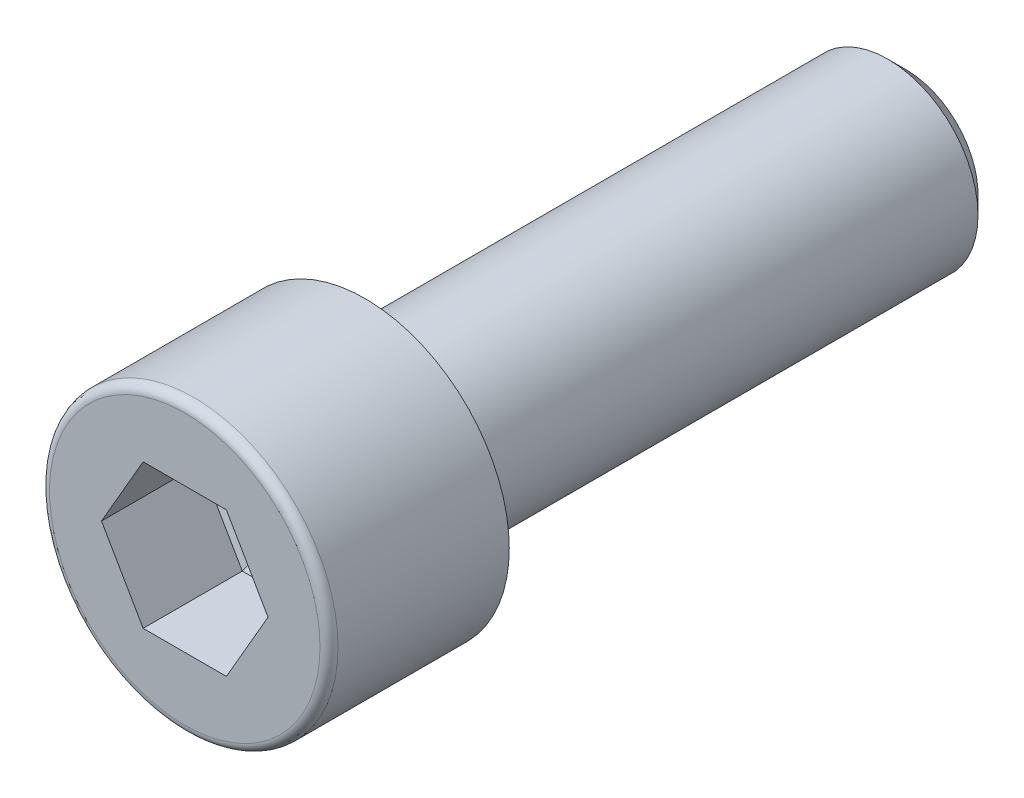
ISO-10303-21;
HEADER;
FILE_DESCRIPTION(('STEP AP214'),'2;1');
FILE_NAME('part.step','',(''),(''),'','','');
FILE_SCHEMA(('AUTOMOTIVE_DESIGN { 1 0 10303 214 1 1 1 1 }'));
ENDSEC;
DATA;
#1=APPLICATION_CONTEXT('core data for automotive mechanical design processes');
#2=APPLICATION_PROTOCOL_DEFINITION('international standard','automotive_design',2000,#1);
#3=PRODUCT_CONTEXT('',#1,'mechanical');
#4=PRODUCT('Part','Part','',(#3));
#5=PRODUCT_RELATED_PRODUCT_CATEGORY('part','',(#4));
#6=PRODUCT_DEFINITION_FORMATION('','',#4);
#7=PRODUCT_DEFINITION_CONTEXT('part definition',#1,'design');
#8=PRODUCT_DEFINITION('design','',#6,#7);
#9=PRODUCT_DEFINITION_SHAPE('','',#8);
#10=(LENGTH_UNIT() NAMED_UNIT(*) SI_UNIT(.MILLI.,.METRE.));
#11=(NAMED_UNIT(*) PLANE_ANGLE_UNIT() SI_UNIT($,.RADIAN.));
#12=(NAMED_UNIT(*) SI_UNIT($,.STERADIAN.) SOLID_ANGLE_UNIT());
#13=UNCERTAINTY_MEASURE_WITH_UNIT(LENGTH_MEASURE(1.E-05),#10,'distance_accuracy_value','');
#14=(GEOMETRIC_REPRESENTATION_CONTEXT(3) GLOBAL_UNCERTAINTY_ASSIGNED_CONTEXT((#13)) GLOBAL_UNIT_ASSIGNED_CONTEXT((#10,
#11,#12)) REPRESENTATION_CONTEXT('',''));
#15=CARTESIAN_POINT('',(0.,0.,0.));
#16=DIRECTION('',(0.,0.,1.));
#17=DIRECTION('',(1.,0.,0.));
#18=AXIS2_PLACEMENT_3D('',#15,#16,#17);
#19=CARTESIAN_POINT('',(0.,0.,0.));
#20=DIRECTION('',(0.,0.,1.));
#21=DIRECTION('',(1.,0.,0.));
#22=AXIS2_PLACEMENT_3D('',#19,#20,#21);
#23=PLANE('',#22);
#24=CARTESIAN_POINT('',(0.,0.,0.));
#25=DIRECTION('',(0.,0.,1.));
#26=DIRECTION('',(1.,0.,0.));
#27=AXIS2_PLACEMENT_3D('',#24,#25,#26);
#28=CIRCLE('',#27,8.);
#29=CARTESIAN_POINT('',(8.,0.,0.));
#30=VERTEX_POINT('',#29);
#31=EDGE_CURVE('E145',#30,#30,#28,.T.);
#32=ORIENTED_EDGE('',*,*,#31,.F.);
#33=EDGE_LOOP('',(#32));
#34=FACE_BOUND('',#33,.T.);
#35=CARTESIAN_POINT('',(0.,0.,0.));
#36=DIRECTION('',(0.,0.,1.));
#37=DIRECTION('',(1.,0.,0.));
#38=AXIS2_PLACEMENT_3D('',#35,#36,#37);
#39=CIRCLE('',#38,5.);
#40=CARTESIAN_POINT('',(5.,0.,0.));
#41=VERTEX_POINT('',#40);
#42=EDGE_CURVE('E163',#41,#41,#39,.F.);
#43=ORIENTED_EDGE('',*,*,#42,.F.);
#44=EDGE_LOOP('',(#43));
#45=FACE_BOUND('',#44,.T.);
#46=ADVANCED_FACE('F26',(#34,#45),#23,.F.);
#47=CARTESIAN_POINT('',(0.,0.,10.));
#48=DIRECTION('',(0.,0.,-1.));
#49=DIRECTION('',(-1.,0.,0.));
#50=AXIS2_PLACEMENT_3D('',#47,#48,#49);
#51=CYLINDRICAL_SURFACE('',#50,8.);
#52=CARTESIAN_POINT('',(0.,0.,9.5));
#53=DIRECTION('',(0.,0.,1.));
#54=DIRECTION('',(1.,0.,0.));
#55=AXIS2_PLACEMENT_3D('',#52,#53,#54);
#56=CIRCLE('',#55,8.);
#57=CARTESIAN_POINT('',(8.,0.,9.5));
#58=VERTEX_POINT('',#57);
#59=EDGE_CURVE('E11',#58,#58,#56,.F.);
#60=ORIENTED_EDGE('',*,*,#59,.T.);
#61=EDGE_LOOP('',(#60));
#62=FACE_BOUND('',#61,.T.);
#63=ORIENTED_EDGE('',*,*,#31,.T.);
#64=EDGE_LOOP('',(#63));
#65=FACE_BOUND('',#64,.T.);
#66=ADVANCED_FACE('F28',(#62,#65),#51,.T.);
#67=CARTESIAN_POINT('',(0.,0.,10.));
#68=DIRECTION('',(0.,0.,1.));
#69=DIRECTION('',(1.,0.,0.));
#70=AXIS2_PLACEMENT_3D('',#67,#68,#69);
#71=PLANE('',#70);
#72=CARTESIAN_POINT('',(0.,0.,10.));
#73=DIRECTION('',(0.,0.,1.));
#74=DIRECTION('',(1.,0.,0.));
#75=AXIS2_PLACEMENT_3D('',#72,#73,#74);
#76=CIRCLE('',#75,7.5);
#77=CARTESIAN_POINT('',(7.5,0.,10.));
#78=VERTEX_POINT('',#77);
#79=EDGE_CURVE('E34',#78,#78,#76,.T.);
#80=ORIENTED_EDGE('',*,*,#79,.T.);
#81=EDGE_LOOP('',(#80));
#82=FACE_BOUND('',#81,.T.);
#83=DIRECTION('',(0.5,0.866025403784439,0.));
#84=VECTOR('',#83,1.);
#85=CARTESIAN_POINT('',(2.3094010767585,-4.,10.));
#86=LINE('',#85,#84);
#87=CARTESIAN_POINT('',(2.3094010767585,-4.,10.));
#88=VERTEX_POINT('',#87);
#89=CARTESIAN_POINT('',(4.61880215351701,0.,10.));
#90=VERTEX_POINT('',#89);
#91=EDGE_CURVE('E90',#88,#90,#86,.T.);
#92=ORIENTED_EDGE('',*,*,#91,.F.);
#93=DIRECTION('',(1.,0.,0.));
#94=VECTOR('',#93,1.);
#95=CARTESIAN_POINT('',(-2.3094010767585,-4.,10.));
#96=LINE('',#95,#94);
#97=CARTESIAN_POINT('',(-2.3094010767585,-4.,10.));
#98=VERTEX_POINT('',#97);
#99=EDGE_CURVE('E139',#98,#88,#96,.T.);
#100=ORIENTED_EDGE('',*,*,#99,.F.);
#101=DIRECTION('',(0.5,-0.866025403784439,0.));
#102=VECTOR('',#101,1.);
#103=CARTESIAN_POINT('',(-4.61880215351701,0.,10.));
#104=LINE('',#103,#102);
#105=CARTESIAN_POINT('',(-4.61880215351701,0.,10.));
#106=VERTEX_POINT('',#105);
#107=EDGE_CURVE('E136',#106,#98,#104,.T.);
#108=ORIENTED_EDGE('',*,*,#107,.F.);
#109=DIRECTION('',(-0.5,-0.866025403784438,0.));
#110=VECTOR('',#109,1.);
#111=CARTESIAN_POINT('',(-2.3094010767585,4.,10.));
#112=LINE('',#111,#110);
#113=CARTESIAN_POINT('',(-2.3094010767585,4.,10.));
#114=VERTEX_POINT('',#113);
#115=EDGE_CURVE('E133',#114,#106,#112,.T.);
#116=ORIENTED_EDGE('',*,*,#115,.F.);
#117=DIRECTION('',(-1.,0.,0.));
#118=VECTOR('',#117,1.);
#119=CARTESIAN_POINT('',(2.3094010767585,4.,10.));
#120=LINE('',#119,#118);
#121=CARTESIAN_POINT('',(2.3094010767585,4.,10.));
#122=VERTEX_POINT('',#121);
#123=EDGE_CURVE('E130',#122,#114,#120,.T.);
#124=ORIENTED_EDGE('',*,*,#123,.F.);
#125=DIRECTION('',(-0.5,0.866025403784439,0.));
#126=VECTOR('',#125,1.);
#127=CARTESIAN_POINT('',(4.61880215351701,0.,10.));
#128=LINE('',#127,#126);
#129=EDGE_CURVE('E127',#90,#122,#128,.T.);
#130=ORIENTED_EDGE('',*,*,#129,.F.);
#131=EDGE_LOOP('',(#92,#100,#108,#116,#124,#130));
#132=FACE_BOUND('',#131,.T.);
#133=ADVANCED_FACE('F174',(#82,#132),#71,.T.);
#134=CARTESIAN_POINT('',(2.3094010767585,-4.,2.5));
#135=DIRECTION('',(0.866025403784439,-0.5,0.));
#136=DIRECTION('',(0.5,0.866025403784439,0.));
#137=AXIS2_PLACEMENT_3D('',#134,#135,#136);
#138=PLANE('',#137);
#139=DIRECTION('',(0.,0.,1.));
#140=VECTOR('',#139,1.);
#141=CARTESIAN_POINT('',(4.61880215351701,0.,2.5));
#142=LINE('',#141,#140);
#143=CARTESIAN_POINT('',(4.61880215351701,0.,4.5));
#144=VERTEX_POINT('',#143);
#145=EDGE_CURVE('E142',#144,#90,#142,.T.);
#146=ORIENTED_EDGE('',*,*,#145,.F.);
#147=DIRECTION('',(-0.5,-0.866025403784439,0.));
#148=VECTOR('',#147,1.);
#149=CARTESIAN_POINT('',(2.3094010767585,-4.,4.5));
#150=LINE('',#149,#148);
#151=CARTESIAN_POINT('',(2.3094010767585,-4.,4.5));
#152=VERTEX_POINT('',#151);
#153=EDGE_CURVE('E112',#144,#152,#150,.T.);
#154=ORIENTED_EDGE('',*,*,#153,.T.);
#155=DIRECTION('',(0.,0.,1.));
#156=VECTOR('',#155,1.);
#157=CARTESIAN_POINT('',(2.3094010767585,-4.,2.5));
#158=LINE('',#157,#156);
#159=EDGE_CURVE('E143',#152,#88,#158,.T.);
#160=ORIENTED_EDGE('',*,*,#159,.T.);
#161=ORIENTED_EDGE('',*,*,#91,.T.);
#162=EDGE_LOOP('',(#146,#154,#160,#161));
#163=FACE_BOUND('',#162,.T.);
#164=ADVANCED_FACE('F199',(#163),#138,.F.);
#165=CARTESIAN_POINT('',(-2.3094010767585,-4.,2.5));
#166=DIRECTION('',(0.,-1.,0.));
#167=DIRECTION('',(1.,0.,0.));
#168=AXIS2_PLACEMENT_3D('',#165,#166,#167);
#169=PLANE('',#168);
#170=ORIENTED_EDGE('',*,*,#159,.F.);
#171=DIRECTION('',(-1.,0.,0.));
#172=VECTOR('',#171,1.);
#173=CARTESIAN_POINT('',(-2.3094010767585,-4.,4.5));
#174=LINE('',#173,#172);
#175=CARTESIAN_POINT('',(-2.3094010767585,-4.,4.5));
#176=VERTEX_POINT('',#175);
#177=EDGE_CURVE('E122',#152,#176,#174,.T.);
#178=ORIENTED_EDGE('',*,*,#177,.T.);
#179=DIRECTION('',(0.,0.,1.));
#180=VECTOR('',#179,1.);
#181=CARTESIAN_POINT('',(-2.3094010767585,-4.,2.5));
#182=LINE('',#181,#180);
#183=EDGE_CURVE('E146',#176,#98,#182,.T.);
#184=ORIENTED_EDGE('',*,*,#183,.T.);
#185=ORIENTED_EDGE('',*,*,#99,.T.);
#186=EDGE_LOOP('',(#170,#178,#184,#185));
#187=FACE_BOUND('',#186,.T.);
#188=ADVANCED_FACE('F205',(#187),#169,.F.);
#189=CARTESIAN_POINT('',(-4.61880215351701,0.,2.5));
#190=DIRECTION('',(-0.866025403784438,-0.5,0.));
#191=DIRECTION('',(0.5,-0.866025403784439,0.));
#192=AXIS2_PLACEMENT_3D('',#189,#190,#191);
#193=PLANE('',#192);
#194=ORIENTED_EDGE('',*,*,#183,.F.);
#195=DIRECTION('',(-0.5,0.866025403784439,0.));
#196=VECTOR('',#195,1.);
#197=CARTESIAN_POINT('',(-4.61880215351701,0.,4.5));
#198=LINE('',#197,#196);
#199=CARTESIAN_POINT('',(-4.61880215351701,0.,4.5));
#200=VERTEX_POINT('',#199);
#201=EDGE_CURVE('E116',#176,#200,#198,.T.);
#202=ORIENTED_EDGE('',*,*,#201,.T.);
#203=DIRECTION('',(0.,0.,1.));
#204=VECTOR('',#203,1.);
#205=CARTESIAN_POINT('',(-4.61880215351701,0.,2.5));
#206=LINE('',#205,#204);
#207=EDGE_CURVE('E148',#200,#106,#206,.T.);
#208=ORIENTED_EDGE('',*,*,#207,.T.);
#209=ORIENTED_EDGE('',*,*,#107,.T.);
#210=EDGE_LOOP('',(#194,#202,#208,#209));
#211=FACE_BOUND('',#210,.T.);
#212=ADVANCED_FACE('F210',(#211),#193,.F.);
#213=CARTESIAN_POINT('',(-2.3094010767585,4.,2.5));
#214=DIRECTION('',(-0.866025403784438,0.5,0.));
#215=DIRECTION('',(-0.5,-0.866025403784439,0.));
#216=AXIS2_PLACEMENT_3D('',#213,#214,#215);
#217=PLANE('',#216);
#218=ORIENTED_EDGE('',*,*,#207,.F.);
#219=DIRECTION('',(0.5,0.866025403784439,0.));
#220=VECTOR('',#219,1.);
#221=CARTESIAN_POINT('',(-2.3094010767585,4.,4.5));
#222=LINE('',#221,#220);
#223=CARTESIAN_POINT('',(-2.3094010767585,4.,4.5));
#224=VERTEX_POINT('',#223);
#225=EDGE_CURVE('E102',#200,#224,#222,.T.);
#226=ORIENTED_EDGE('',*,*,#225,.T.);
#227=DIRECTION('',(0.,0.,1.));
#228=VECTOR('',#227,1.);
#229=CARTESIAN_POINT('',(-2.3094010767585,4.,2.5));
#230=LINE('',#229,#228);
#231=EDGE_CURVE('E150',#224,#114,#230,.T.);
#232=ORIENTED_EDGE('',*,*,#231,.T.);
#233=ORIENTED_EDGE('',*,*,#115,.T.);
#234=EDGE_LOOP('',(#218,#226,#232,#233));
#235=FACE_BOUND('',#234,.T.);
#236=ADVANCED_FACE('F223',(#235),#217,.F.);
#237=CARTESIAN_POINT('',(2.3094010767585,4.,2.5));
#238=DIRECTION('',(0.,1.,0.));
#239=DIRECTION('',(-1.,0.,0.));
#240=AXIS2_PLACEMENT_3D('',#237,#238,#239);
#241=PLANE('',#240);
#242=ORIENTED_EDGE('',*,*,#231,.F.);
#243=DIRECTION('',(1.,0.,0.));
#244=VECTOR('',#243,1.);
#245=CARTESIAN_POINT('',(2.3094010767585,4.,4.5));
#246=LINE('',#245,#244);
#247=CARTESIAN_POINT('',(2.3094010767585,4.,4.5));
#248=VERTEX_POINT('',#247);
#249=EDGE_CURVE('E49',#224,#248,#246,.T.);
#250=ORIENTED_EDGE('',*,*,#249,.T.);
#251=DIRECTION('',(0.,0.,1.));
#252=VECTOR('',#251,1.);
#253=CARTESIAN_POINT('',(2.3094010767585,4.,2.5));
#254=LINE('',#253,#252);
#255=EDGE_CURVE('E152',#248,#122,#254,.T.);
#256=ORIENTED_EDGE('',*,*,#255,.T.);
#257=ORIENTED_EDGE('',*,*,#123,.T.);
#258=EDGE_LOOP('',(#242,#250,#256,#257));
#259=FACE_BOUND('',#258,.T.);
#260=ADVANCED_FACE('F220',(#259),#241,.F.);
#261=CARTESIAN_POINT('',(4.61880215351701,0.,2.5));
#262=DIRECTION('',(0.866025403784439,0.5,0.));
#263=DIRECTION('',(-0.5,0.866025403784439,0.));
#264=AXIS2_PLACEMENT_3D('',#261,#262,#263);
#265=PLANE('',#264);
#266=ORIENTED_EDGE('',*,*,#255,.F.);
#267=DIRECTION('',(0.5,-0.866025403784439,0.));
#268=VECTOR('',#267,1.);
#269=CARTESIAN_POINT('',(4.61880215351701,0.,4.5));
#270=LINE('',#269,#268);
#271=EDGE_CURVE('E41',#248,#144,#270,.T.);
#272=ORIENTED_EDGE('',*,*,#271,.T.);
#273=ORIENTED_EDGE('',*,*,#145,.T.);
#274=ORIENTED_EDGE('',*,*,#129,.T.);
#275=EDGE_LOOP('',(#266,#272,#273,#274));
#276=FACE_BOUND('',#275,.T.);
#277=ADVANCED_FACE('F216',(#276),#265,.F.);
#278=CARTESIAN_POINT('',(0.,0.,2.5));
#279=DIRECTION('',(0.,-0.447213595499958,0.894427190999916));
#280=DIRECTION('',(0.,-0.894427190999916,-0.447213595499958));
#281=AXIS2_PLACEMENT_3D('',#278,#279,#280);
#282=PLANE('',#281);
#283=DIRECTION('',(-0.458831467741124,-0.794719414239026,-0.397359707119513));
#284=VECTOR('',#283,1.);
#285=CARTESIAN_POINT('',(0.,0.,2.5));
#286=LINE('',#285,#284);
#287=CARTESIAN_POINT('',(0.,0.,2.5));
#288=VERTEX_POINT('',#287);
#289=EDGE_CURVE('E86',#248,#288,#286,.T.);
#290=ORIENTED_EDGE('',*,*,#289,.F.);
#291=ORIENTED_EDGE('',*,*,#249,.F.);
#292=DIRECTION('',(0.458831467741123,-0.794719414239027,-0.397359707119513));
#293=VECTOR('',#292,1.);
#294=CARTESIAN_POINT('',(1.45856910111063,-2.52631578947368,1.23684210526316));
#295=LINE('',#294,#293);
#296=EDGE_CURVE('E83',#288,#224,#295,.F.);
#297=ORIENTED_EDGE('',*,*,#296,.F.);
#298=EDGE_LOOP('',(#290,#291,#297));
#299=FACE_BOUND('',#298,.T.);
#300=ADVANCED_FACE('F85',(#299),#282,.T.);
#301=CARTESIAN_POINT('',(-3.46410161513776,-6.,2.5));
#302=DIRECTION('',(0.387298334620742,-0.223606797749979,0.894427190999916));
#303=DIRECTION('',(0.917662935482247,0.,-0.397359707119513));
#304=AXIS2_PLACEMENT_3D('',#301,#302,#303);
#305=PLANE('',#304);
#306=ORIENTED_EDGE('',*,*,#296,.T.);
#307=ORIENTED_EDGE('',*,*,#225,.F.);
#308=DIRECTION('',(0.917662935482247,0.,-0.397359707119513));
#309=VECTOR('',#308,1.);
#310=CARTESIAN_POINT('',(2.91713820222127,0.,1.23684210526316));
#311=LINE('',#310,#309);
#312=EDGE_CURVE('E98',#288,#200,#311,.F.);
#313=ORIENTED_EDGE('',*,*,#312,.F.);
#314=EDGE_LOOP('',(#306,#307,#313));
#315=FACE_BOUND('',#314,.T.);
#316=ADVANCED_FACE('F101',(#315),#305,.T.);
#317=CARTESIAN_POINT('',(3.46410161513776,-6.,2.5));
#318=DIRECTION('',(-0.387298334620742,-0.223606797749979,0.894427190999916));
#319=DIRECTION('',(0.917662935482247,0.,0.397359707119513));
#320=AXIS2_PLACEMENT_3D('',#317,#318,#319);
#321=PLANE('',#320);
#322=ORIENTED_EDGE('',*,*,#271,.F.);
#323=ORIENTED_EDGE('',*,*,#289,.T.);
#324=DIRECTION('',(-0.917662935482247,0.,-0.397359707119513));
#325=VECTOR('',#324,1.);
#326=CARTESIAN_POINT('',(2.91713820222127,0.,3.76315789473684));
#327=LINE('',#326,#325);
#328=EDGE_CURVE('E96',#144,#288,#327,.T.);
#329=ORIENTED_EDGE('',*,*,#328,.F.);
#330=EDGE_LOOP('',(#322,#323,#329));
#331=FACE_BOUND('',#330,.T.);
#332=ADVANCED_FACE('F94',(#331),#321,.T.);
#333=CARTESIAN_POINT('',(3.46410161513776,-6.,2.5));
#334=DIRECTION('',(0.387298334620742,0.223606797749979,0.894427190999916));
#335=DIRECTION('',(0.917662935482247,0.,-0.397359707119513));
#336=AXIS2_PLACEMENT_3D('',#333,#334,#335);
#337=PLANE('',#336);
#338=ORIENTED_EDGE('',*,*,#312,.T.);
#339=ORIENTED_EDGE('',*,*,#201,.F.);
#340=DIRECTION('',(0.458831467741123,0.794719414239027,-0.397359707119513));
#341=VECTOR('',#340,1.);
#342=CARTESIAN_POINT('',(0.,0.,2.5));
#343=LINE('',#342,#341);
#344=EDGE_CURVE('E113',#288,#176,#343,.F.);
#345=ORIENTED_EDGE('',*,*,#344,.F.);
#346=EDGE_LOOP('',(#338,#339,#345));
#347=FACE_BOUND('',#346,.T.);
#348=ADVANCED_FACE('F115',(#347),#337,.T.);
#349=CARTESIAN_POINT('',(-3.46410161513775,-6.,2.5));
#350=DIRECTION('',(-0.387298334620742,0.223606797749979,0.894427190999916));
#351=DIRECTION('',(0.917662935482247,0.,0.397359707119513));
#352=AXIS2_PLACEMENT_3D('',#349,#350,#351);
#353=PLANE('',#352);
#354=ORIENTED_EDGE('',*,*,#153,.F.);
#355=ORIENTED_EDGE('',*,*,#328,.T.);
#356=DIRECTION('',(0.458831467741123,-0.794719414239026,0.397359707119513));
#357=VECTOR('',#356,1.);
#358=CARTESIAN_POINT('',(0.,0.,2.5));
#359=LINE('',#358,#357);
#360=EDGE_CURVE('E111',#152,#288,#359,.F.);
#361=ORIENTED_EDGE('',*,*,#360,.F.);
#362=EDGE_LOOP('',(#354,#355,#361));
#363=FACE_BOUND('',#362,.T.);
#364=ADVANCED_FACE('F109',(#363),#353,.T.);
#365=CARTESIAN_POINT('',(0.,0.,2.5));
#366=DIRECTION('',(0.,0.447213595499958,0.894427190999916));
#367=DIRECTION('',(0.,-0.894427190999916,0.447213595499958));
#368=AXIS2_PLACEMENT_3D('',#365,#366,#367);
#369=PLANE('',#368);
#370=ORIENTED_EDGE('',*,*,#344,.T.);
#371=ORIENTED_EDGE('',*,*,#177,.F.);
#372=ORIENTED_EDGE('',*,*,#360,.T.);
#373=EDGE_LOOP('',(#370,#371,#372));
#374=FACE_BOUND('',#373,.T.);
#375=ADVANCED_FACE('F121',(#374),#369,.T.);
#376=CARTESIAN_POINT('',(0.,0.,-30.));
#377=DIRECTION('',(0.,0.,1.));
#378=DIRECTION('',(1.,0.,0.));
#379=AXIS2_PLACEMENT_3D('',#376,#377,#378);
#380=CYLINDRICAL_SURFACE('',#379,5.);
#381=CARTESIAN_POINT('',(0.,0.,-29.));
#382=DIRECTION('',(0.,0.,-1.));
#383=DIRECTION('',(-1.,0.,0.));
#384=AXIS2_PLACEMENT_3D('',#381,#382,#383);
#385=CIRCLE('',#384,5.);
#386=CARTESIAN_POINT('',(-5.,0.,-29.));
#387=VERTEX_POINT('',#386);
#388=EDGE_CURVE('E169',#387,#387,#385,.F.);
#389=ORIENTED_EDGE('',*,*,#388,.T.);
#390=EDGE_LOOP('',(#389));
#391=FACE_BOUND('',#390,.T.);
#392=ORIENTED_EDGE('',*,*,#42,.T.);
#393=EDGE_LOOP('',(#392));
#394=FACE_BOUND('',#393,.T.);
#395=ADVANCED_FACE('F253',(#391,#394),#380,.T.);
#396=CARTESIAN_POINT('',(0.,0.,-30.));
#397=DIRECTION('',(0.,0.,-1.));
#398=DIRECTION('',(-1.,0.,0.));
#399=AXIS2_PLACEMENT_3D('',#396,#397,#398);
#400=PLANE('',#399);
#401=CARTESIAN_POINT('',(0.,0.,-30.));
#402=DIRECTION('',(0.,0.,-1.));
#403=DIRECTION('',(-1.,0.,0.));
#404=AXIS2_PLACEMENT_3D('',#401,#402,#403);
#405=CIRCLE('',#404,3.99999999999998);
#406=CARTESIAN_POINT('',(-3.99999999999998,0.,-30.));
#407=VERTEX_POINT('',#406);
#408=EDGE_CURVE('E166',#407,#407,#405,.T.);
#409=ORIENTED_EDGE('',*,*,#408,.T.);
#410=EDGE_LOOP('',(#409));
#411=FACE_BOUND('',#410,.T.);
#412=ADVANCED_FACE('F185',(#411),#400,.T.);
#413=CARTESIAN_POINT('',(0.,0.,-30.));
#414=DIRECTION('',(0.,0.,1.));
#415=DIRECTION('',(1.,0.,0.));
#416=AXIS2_PLACEMENT_3D('',#413,#414,#415);
#417=CONICAL_SURFACE('',#416,3.99999999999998,0.785398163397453);
#418=ORIENTED_EDGE('',*,*,#388,.F.);
#419=EDGE_LOOP('',(#418));
#420=FACE_BOUND('',#419,.T.);
#421=ORIENTED_EDGE('',*,*,#408,.F.);
#422=EDGE_LOOP('',(#421));
#423=FACE_BOUND('',#422,.T.);
#424=ADVANCED_FACE('F179',(#420,#423),#417,.T.);
#425=CARTESIAN_POINT('',(0.,0.,9.5));
#426=DIRECTION('',(0.,0.,1.));
#427=DIRECTION('',(1.,0.,0.));
#428=AXIS2_PLACEMENT_3D('',#425,#426,#427);
#429=TOROIDAL_SURFACE('',#428,7.5,0.5);
#430=ORIENTED_EDGE('',*,*,#59,.F.);
#431=EDGE_LOOP('',(#430));
#432=FACE_BOUND('',#431,.T.);
#433=ORIENTED_EDGE('',*,*,#79,.F.);
#434=EDGE_LOOP('',(#433));
#435=FACE_BOUND('',#434,.T.);
#436=ADVANCED_FACE('F177',(#432,#435),#429,.T.);
#437=CLOSED_SHELL('',(#46,#66,#133,#164,#188,#212,#236,#260,#277,#300,#316,#332,#348,#364,#375,
#395,#412,#424,#436));
#438=MANIFOLD_SOLID_BREP('B2',#437);
#439=ADVANCED_BREP_SHAPE_REPRESENTATION('',(#18,#438),#14);
#440=SHAPE_DEFINITION_REPRESENTATION(#9,#439);
ENDSEC;
END-ISO-10303-21;
